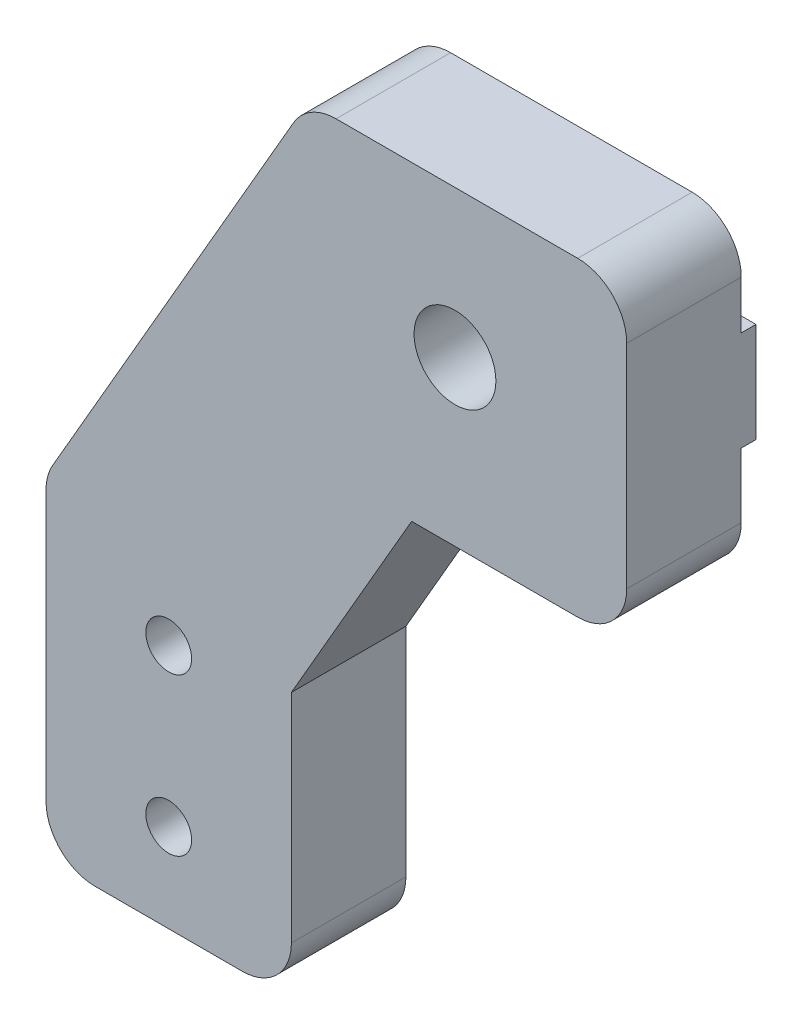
from build123d import *

# Parameters (mm, degrees)
SKETCH1_R           = 2.5
SKETCH1_R_2         = 1.4
BOSS_EXTRUDE1_DEPTH = 7
BOSS_EXTRUDE2_REACH = 62.11
SKETCH2_W           = 0.9
SKETCH2_H           = 6.1
CUT_EXTRUDE1_REACH  = 62.11
SKETCH3_R           = 2.5


with BuildPart() as part:
    # Sketch1 → Boss-Extrude1 (new body)
    with BuildSketch(Plane.XY):
        with BuildLine():
            Line((3, 0), (12, 0))
            ThreePointArc((12, 0), (14.121320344, 0.878679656), (15, 3))
            Line((15, 3), (15, 16.267949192))
            Line((15, 16.267949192), (22.350852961, 29))
            Line((22.350852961, 29), (32.5, 29))
            ThreePointArc((32.5, 29), (34.621320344, 29.878679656), (35.5, 32))
            Line((35.5, 32), (35.5, 45))
            ThreePointArc((35.5, 45), (34.621320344, 47.121320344), (32.5, 48))
            Line((32.5, 48), (17.732050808, 48))
            ThreePointArc((17.732050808, 48), (16.232050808, 47.598076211), (15.133974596, 46.5))
            Line((15.133974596, 46.5), (0.401923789, 20.983339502))
            ThreePointArc((0.401923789, 20.983339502), (0.102222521, 20.259796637), (0, 19.483339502))
            Line((0, 19.483339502), (0, 3))
            ThreePointArc((0, 3), (0.878679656, 0.878679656), (3, 0))
        make_face()
        with Locations((25, 39)):
            Circle(SKETCH1_R, mode=Mode.SUBTRACT)
        with Locations((7.5, 5.4)):
            Circle(SKETCH1_R_2, mode=Mode.SUBTRACT)
        with Locations((7.5, 15)):
            Circle(SKETCH1_R_2, mode=Mode.SUBTRACT)
    extrude(amount=BOSS_EXTRUDE1_DEPTH)

    # Boss-Extrude2: up to this plane
    boss_extrude2_end = Plane(origin=(15.133974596, 46.5, 7), z_dir=(0.86602540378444, -0.4999999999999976, 0))
    # Sketch2 → Boss-Extrude2 (add, up to the surface)
    with BuildSketch(Plane(origin=(35.5, 0, 0), x_dir=(0, 0, -1), z_dir=(1, 0, 0)), mode=Mode.PRIVATE) as boss_extrude2_sk1:
        with Locations((0.45, 39)):
            Rectangle(SKETCH2_W, SKETCH2_H)
    boss_extrude2_tool1 = split(extrude(boss_extrude2_sk1.sketch, amount=-BOSS_EXTRUDE2_REACH, mode=Mode.PRIVATE), bisect_by=boss_extrude2_end, keep=Keep.BOTH, mode=Mode.PRIVATE)
    add(boss_extrude2_tool1.solids().sort_by_distance((35.5, 39, -0.45))[0])

    # Sketch3 → Cut-Extrude1 (cut, up to next)
    with BuildSketch(Plane.XY, mode=Mode.PRIVATE) as cut_extrude1_sk1:
        with Locations(Location((25, 39, 0), (0, 0, 270))):
            Circle(SKETCH3_R)
    cut_extrude1_tool1 = extrude(cut_extrude1_sk1.sketch, amount=-CUT_EXTRUDE1_REACH, mode=Mode.PRIVATE) & part.part
    add(cut_extrude1_tool1.solids().sort_by_distance((25, 39, 0))[0], mode=Mode.SUBTRACT)


solid = part.part
